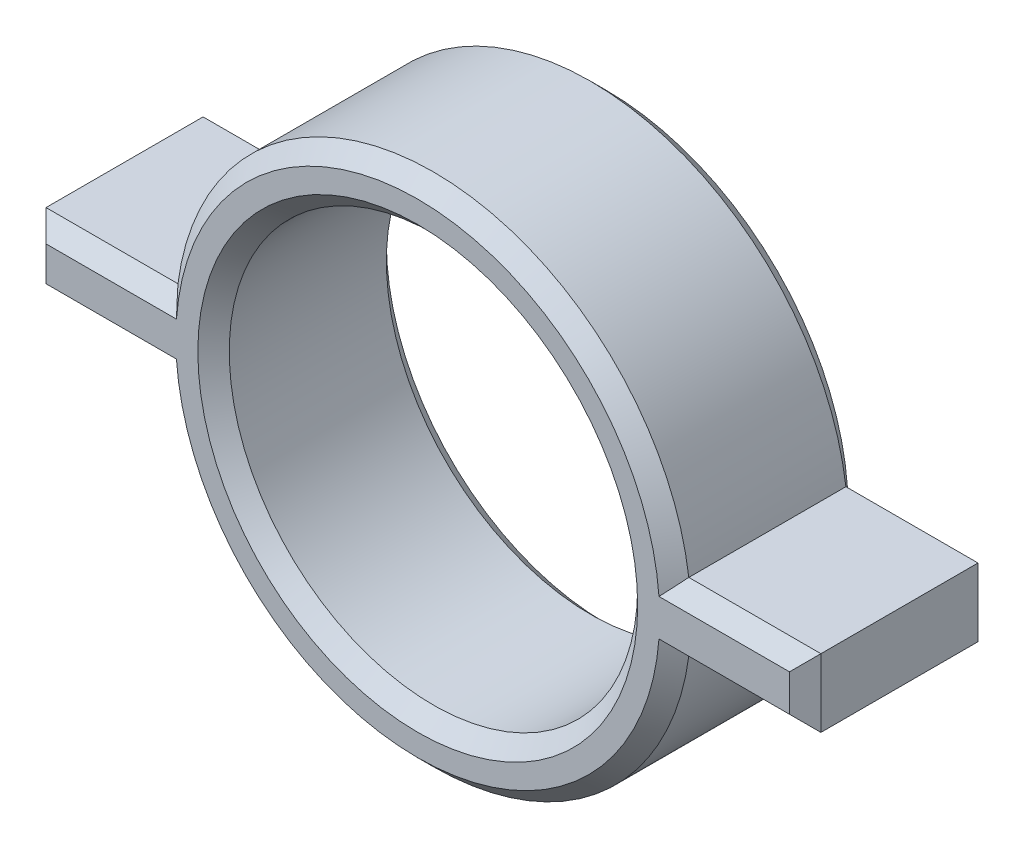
ISO-10303-21;
HEADER;
FILE_DESCRIPTION(('STEP AP214'),'2;1');
FILE_NAME('part.step','',(''),(''),'','','');
FILE_SCHEMA(('AUTOMOTIVE_DESIGN { 1 0 10303 214 1 1 1 1 }'));
ENDSEC;
DATA;
#1=APPLICATION_CONTEXT('core data for automotive mechanical design processes');
#2=APPLICATION_PROTOCOL_DEFINITION('international standard','automotive_design',2000,#1);
#3=PRODUCT_CONTEXT('',#1,'mechanical');
#4=PRODUCT('Part','Part','',(#3));
#5=PRODUCT_RELATED_PRODUCT_CATEGORY('part','',(#4));
#6=PRODUCT_DEFINITION_FORMATION('','',#4);
#7=PRODUCT_DEFINITION_CONTEXT('part definition',#1,'design');
#8=PRODUCT_DEFINITION('design','',#6,#7);
#9=PRODUCT_DEFINITION_SHAPE('','',#8);
#10=(LENGTH_UNIT() NAMED_UNIT(*) SI_UNIT(.MILLI.,.METRE.));
#11=(NAMED_UNIT(*) PLANE_ANGLE_UNIT() SI_UNIT($,.RADIAN.));
#12=(NAMED_UNIT(*) SI_UNIT($,.STERADIAN.) SOLID_ANGLE_UNIT());
#13=UNCERTAINTY_MEASURE_WITH_UNIT(LENGTH_MEASURE(1.E-05),#10,'distance_accuracy_value','');
#14=(GEOMETRIC_REPRESENTATION_CONTEXT(3) GLOBAL_UNCERTAINTY_ASSIGNED_CONTEXT((#13)) GLOBAL_UNIT_ASSIGNED_CONTEXT((#10,
#11,#12)) REPRESENTATION_CONTEXT('',''));
#15=CARTESIAN_POINT('',(0.,0.,0.));
#16=DIRECTION('',(0.,0.,1.));
#17=DIRECTION('',(1.,0.,0.));
#18=AXIS2_PLACEMENT_3D('',#15,#16,#17);
#19=CARTESIAN_POINT('',(0.,0.,6.));
#20=DIRECTION('',(0.,0.,1.));
#21=DIRECTION('',(1.,0.,0.));
#22=AXIS2_PLACEMENT_3D('',#19,#20,#21);
#23=PLANE('',#22);
#24=CARTESIAN_POINT('',(0.,0.,6.));
#25=DIRECTION('',(0.,0.,1.));
#26=DIRECTION('',(1.,0.,0.));
#27=AXIS2_PLACEMENT_3D('',#24,#25,#26);
#28=CIRCLE('',#27,7.00000000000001);
#29=CARTESIAN_POINT('',(7.00000000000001,0.,6.));
#30=VERTEX_POINT('',#29);
#31=EDGE_CURVE('E182',#30,#30,#28,.F.);
#32=ORIENTED_EDGE('',*,*,#31,.T.);
#33=EDGE_LOOP('',(#32));
#34=FACE_BOUND('',#33,.T.);
#35=DIRECTION('',(-1.,0.,0.));
#36=VECTOR('',#35,1.);
#37=CARTESIAN_POINT('',(8.12786175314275,0.585294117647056,6.));
#38=LINE('',#37,#36);
#39=CARTESIAN_POINT('',(11.8324965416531,0.58529411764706,6.));
#40=VERTEX_POINT('',#39);
#41=CARTESIAN_POINT('',(7.6777230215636,0.585294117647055,6.));
#42=VERTEX_POINT('',#41);
#43=EDGE_CURVE('E180',#40,#42,#38,.T.);
#44=ORIENTED_EDGE('',*,*,#43,.T.);
#45=CARTESIAN_POINT('',(0.,0.,6.));
#46=DIRECTION('',(0.,0.,1.));
#47=DIRECTION('',(1.,0.,0.));
#48=AXIS2_PLACEMENT_3D('',#45,#46,#47);
#49=CIRCLE('',#48,7.7);
#50=CARTESIAN_POINT('',(-7.68033202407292,0.55,6.));
#51=VERTEX_POINT('',#50);
#52=EDGE_CURVE('E162',#42,#51,#49,.T.);
#53=ORIENTED_EDGE('',*,*,#52,.T.);
#54=DIRECTION('',(-1.,0.,0.));
#55=VECTOR('',#54,1.);
#56=CARTESIAN_POINT('',(-12.3324965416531,0.549999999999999,6.));
#57=LINE('',#56,#55);
#58=CARTESIAN_POINT('',(-11.8324965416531,0.55,6.));
#59=VERTEX_POINT('',#58);
#60=EDGE_CURVE('E170',#51,#59,#57,.T.);
#61=ORIENTED_EDGE('',*,*,#60,.T.);
#62=DIRECTION('',(0.,-1.,0.));
#63=VECTOR('',#62,1.);
#64=CARTESIAN_POINT('',(-11.8324965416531,-1.05,6.));
#65=LINE('',#64,#63);
#66=CARTESIAN_POINT('',(-11.8324965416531,-0.55,6.));
#67=VERTEX_POINT('',#66);
#68=EDGE_CURVE('E176',#59,#67,#65,.T.);
#69=ORIENTED_EDGE('',*,*,#68,.T.);
#70=DIRECTION('',(1.,0.,0.));
#71=VECTOR('',#70,1.);
#72=CARTESIAN_POINT('',(-8.13249654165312,-0.55,6.));
#73=LINE('',#72,#71);
#74=CARTESIAN_POINT('',(-7.68033202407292,-0.55,6.));
#75=VERTEX_POINT('',#74);
#76=EDGE_CURVE('E445',#67,#75,#73,.T.);
#77=ORIENTED_EDGE('',*,*,#76,.T.);
#78=CARTESIAN_POINT('',(0.,0.,6.));
#79=DIRECTION('',(0.,0.,1.));
#80=DIRECTION('',(1.,0.,0.));
#81=AXIS2_PLACEMENT_3D('',#78,#79,#80);
#82=CIRCLE('',#81,7.7);
#83=CARTESIAN_POINT('',(7.6777230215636,-0.585294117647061,6.));
#84=VERTEX_POINT('',#83);
#85=EDGE_CURVE('E447',#75,#84,#82,.T.);
#86=ORIENTED_EDGE('',*,*,#85,.T.);
#87=DIRECTION('',(1.,0.,0.));
#88=VECTOR('',#87,1.);
#89=CARTESIAN_POINT('',(12.3324965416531,-0.58529411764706,6.));
#90=LINE('',#89,#88);
#91=CARTESIAN_POINT('',(11.8324965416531,-0.58529411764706,6.));
#92=VERTEX_POINT('',#91);
#93=EDGE_CURVE('E449',#84,#92,#90,.T.);
#94=ORIENTED_EDGE('',*,*,#93,.T.);
#95=DIRECTION('',(0.,1.,0.));
#96=VECTOR('',#95,1.);
#97=CARTESIAN_POINT('',(11.8324965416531,1.08529411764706,6.));
#98=LINE('',#97,#96);
#99=EDGE_CURVE('E187',#92,#40,#98,.T.);
#100=ORIENTED_EDGE('',*,*,#99,.T.);
#101=EDGE_LOOP('',(#44,#53,#61,#69,#77,#86,#94,#100));
#102=FACE_BOUND('',#101,.T.);
#103=ADVANCED_FACE('F41',(#34,#102),#23,.T.);
#104=CARTESIAN_POINT('',(0.,0.,0.));
#105=DIRECTION('',(0.,0.,1.));
#106=DIRECTION('',(1.,0.,0.));
#107=AXIS2_PLACEMENT_3D('',#104,#105,#106);
#108=PLANE('',#107);
#109=CARTESIAN_POINT('',(0.,0.,0.));
#110=DIRECTION('',(0.,0.,1.));
#111=DIRECTION('',(1.,0.,0.));
#112=AXIS2_PLACEMENT_3D('',#109,#110,#111);
#113=CIRCLE('',#112,7.);
#114=CARTESIAN_POINT('',(7.,0.,0.));
#115=VERTEX_POINT('',#114);
#116=EDGE_CURVE('E11',#115,#115,#113,.T.);
#117=ORIENTED_EDGE('',*,*,#116,.T.);
#118=EDGE_LOOP('',(#117));
#119=FACE_BOUND('',#118,.T.);
#120=DIRECTION('',(-1.,0.,0.));
#121=VECTOR('',#120,1.);
#122=CARTESIAN_POINT('',(0.,-0.549999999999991,0.));
#123=LINE('',#122,#121);
#124=CARTESIAN_POINT('',(-7.68033202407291,-0.54999999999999,0.));
#125=VERTEX_POINT('',#124);
#126=CARTESIAN_POINT('',(-11.8324965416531,-0.549999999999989,0.));
#127=VERTEX_POINT('',#126);
#128=EDGE_CURVE('E59',#125,#127,#123,.T.);
#129=ORIENTED_EDGE('',*,*,#128,.T.);
#130=DIRECTION('',(0.,1.,0.));
#131=VECTOR('',#130,1.);
#132=CARTESIAN_POINT('',(-11.8324965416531,0.,0.));
#133=LINE('',#132,#131);
#134=CARTESIAN_POINT('',(-11.8324965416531,0.549999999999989,0.));
#135=VERTEX_POINT('',#134);
#136=EDGE_CURVE('E51',#127,#135,#133,.T.);
#137=ORIENTED_EDGE('',*,*,#136,.T.);
#138=DIRECTION('',(1.,0.,0.));
#139=VECTOR('',#138,1.);
#140=CARTESIAN_POINT('',(0.,0.549999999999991,0.));
#141=LINE('',#140,#139);
#142=CARTESIAN_POINT('',(-7.68033202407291,0.54999999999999,0.));
#143=VERTEX_POINT('',#142);
#144=EDGE_CURVE('E222',#135,#143,#141,.T.);
#145=ORIENTED_EDGE('',*,*,#144,.T.);
#146=CARTESIAN_POINT('',(0.,0.,0.));
#147=DIRECTION('',(0.,0.,1.));
#148=DIRECTION('',(1.,0.,0.));
#149=AXIS2_PLACEMENT_3D('',#146,#147,#148);
#150=CIRCLE('',#149,7.69999999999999);
#151=CARTESIAN_POINT('',(7.67772302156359,0.585294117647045,0.));
#152=VERTEX_POINT('',#151);
#153=EDGE_CURVE('E224',#143,#152,#150,.F.);
#154=ORIENTED_EDGE('',*,*,#153,.T.);
#155=DIRECTION('',(1.,0.,0.));
#156=VECTOR('',#155,1.);
#157=CARTESIAN_POINT('',(0.,0.585294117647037,0.));
#158=LINE('',#157,#156);
#159=CARTESIAN_POINT('',(11.8324965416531,0.58529411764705,0.));
#160=VERTEX_POINT('',#159);
#161=EDGE_CURVE('E226',#152,#160,#158,.T.);
#162=ORIENTED_EDGE('',*,*,#161,.T.);
#163=DIRECTION('',(0.,-1.,0.));
#164=VECTOR('',#163,1.);
#165=CARTESIAN_POINT('',(11.8324965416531,0.,0.));
#166=LINE('',#165,#164);
#167=CARTESIAN_POINT('',(11.8324965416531,-0.58529411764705,0.));
#168=VERTEX_POINT('',#167);
#169=EDGE_CURVE('E228',#160,#168,#166,.T.);
#170=ORIENTED_EDGE('',*,*,#169,.T.);
#171=DIRECTION('',(-1.,0.,0.));
#172=VECTOR('',#171,1.);
#173=CARTESIAN_POINT('',(0.,-0.58529411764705,0.));
#174=LINE('',#173,#172);
#175=CARTESIAN_POINT('',(7.67772302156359,-0.58529411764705,0.));
#176=VERTEX_POINT('',#175);
#177=EDGE_CURVE('E230',#168,#176,#174,.T.);
#178=ORIENTED_EDGE('',*,*,#177,.T.);
#179=CARTESIAN_POINT('',(0.,0.,0.));
#180=DIRECTION('',(0.,0.,1.));
#181=DIRECTION('',(1.,0.,0.));
#182=AXIS2_PLACEMENT_3D('',#179,#180,#181);
#183=CIRCLE('',#182,7.69999999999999);
#184=EDGE_CURVE('E64',#176,#125,#183,.F.);
#185=ORIENTED_EDGE('',*,*,#184,.T.);
#186=EDGE_LOOP('',(#129,#137,#145,#154,#162,#170,#178,#185));
#187=FACE_BOUND('',#186,.T.);
#188=ADVANCED_FACE('F411',(#119,#187),#108,.F.);
#189=CARTESIAN_POINT('',(-8.13249654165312,1.05,6.));
#190=DIRECTION('',(0.,-1.,0.));
#191=DIRECTION('',(1.,0.,0.));
#192=AXIS2_PLACEMENT_3D('',#189,#190,#191);
#193=PLANE('',#192);
#194=DIRECTION('',(0.,0.,-1.));
#195=VECTOR('',#194,1.);
#196=CARTESIAN_POINT('',(-12.3324965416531,1.05,6.));
#197=LINE('',#196,#195);
#198=CARTESIAN_POINT('',(-12.3324965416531,1.05,5.5));
#199=VERTEX_POINT('',#198);
#200=CARTESIAN_POINT('',(-12.3324965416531,1.05,0.500000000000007));
#201=VERTEX_POINT('',#200);
#202=EDGE_CURVE('E426',#199,#201,#197,.T.);
#203=ORIENTED_EDGE('',*,*,#202,.F.);
#204=DIRECTION('',(1.,0.,0.));
#205=VECTOR('',#204,1.);
#206=CARTESIAN_POINT('',(-8.13249654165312,1.05,5.5));
#207=LINE('',#206,#205);
#208=CARTESIAN_POINT('',(-8.13249654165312,1.05,5.5));
#209=VERTEX_POINT('',#208);
#210=EDGE_CURVE('E220',#199,#209,#207,.T.);
#211=ORIENTED_EDGE('',*,*,#210,.T.);
#212=DIRECTION('',(0.,0.,-1.));
#213=VECTOR('',#212,1.);
#214=CARTESIAN_POINT('',(-8.13249654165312,1.05,6.));
#215=LINE('',#214,#213);
#216=CARTESIAN_POINT('',(-8.13249654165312,1.05,0.500000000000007));
#217=VERTEX_POINT('',#216);
#218=EDGE_CURVE('E307',#209,#217,#215,.T.);
#219=ORIENTED_EDGE('',*,*,#218,.T.);
#220=DIRECTION('',(-1.,0.,0.));
#221=VECTOR('',#220,1.);
#222=CARTESIAN_POINT('',(-8.13249654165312,1.05,0.500000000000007));
#223=LINE('',#222,#221);
#224=EDGE_CURVE('E218',#217,#201,#223,.T.);
#225=ORIENTED_EDGE('',*,*,#224,.T.);
#226=EDGE_LOOP('',(#203,#211,#219,#225));
#227=FACE_BOUND('',#226,.T.);
#228=ADVANCED_FACE('F425',(#227),#193,.F.);
#229=CARTESIAN_POINT('',(-12.3324965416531,1.05,6.));
#230=DIRECTION('',(1.,0.,0.));
#231=DIRECTION('',(0.,0.,-1.));
#232=AXIS2_PLACEMENT_3D('',#229,#230,#231);
#233=PLANE('',#232);
#234=DIRECTION('',(0.,0.,-1.));
#235=VECTOR('',#234,1.);
#236=CARTESIAN_POINT('',(-12.3324965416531,-1.05,6.));
#237=LINE('',#236,#235);
#238=CARTESIAN_POINT('',(-12.3324965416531,-1.05,5.5));
#239=VERTEX_POINT('',#238);
#240=CARTESIAN_POINT('',(-12.3324965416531,-1.05,0.500000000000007));
#241=VERTEX_POINT('',#240);
#242=EDGE_CURVE('E434',#239,#241,#237,.T.);
#243=ORIENTED_EDGE('',*,*,#242,.F.);
#244=DIRECTION('',(0.,1.,0.));
#245=VECTOR('',#244,1.);
#246=CARTESIAN_POINT('',(-12.3324965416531,1.05,5.5));
#247=LINE('',#246,#245);
#248=EDGE_CURVE('E216',#239,#199,#247,.T.);
#249=ORIENTED_EDGE('',*,*,#248,.T.);
#250=ORIENTED_EDGE('',*,*,#202,.T.);
#251=DIRECTION('',(0.,-1.,0.));
#252=VECTOR('',#251,1.);
#253=CARTESIAN_POINT('',(-12.3324965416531,1.05,0.500000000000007));
#254=LINE('',#253,#252);
#255=EDGE_CURVE('E213',#201,#241,#254,.T.);
#256=ORIENTED_EDGE('',*,*,#255,.T.);
#257=EDGE_LOOP('',(#243,#249,#250,#256));
#258=FACE_BOUND('',#257,.T.);
#259=ADVANCED_FACE('F430',(#258),#233,.F.);
#260=CARTESIAN_POINT('',(-12.3324965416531,-1.05,6.));
#261=DIRECTION('',(0.,1.,0.));
#262=DIRECTION('',(-1.,0.,0.));
#263=AXIS2_PLACEMENT_3D('',#260,#261,#262);
#264=PLANE('',#263);
#265=DIRECTION('',(0.,0.,-1.));
#266=VECTOR('',#265,1.);
#267=CARTESIAN_POINT('',(-8.13249654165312,-1.05,6.));
#268=LINE('',#267,#266);
#269=CARTESIAN_POINT('',(-8.13249654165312,-1.05,5.5));
#270=VERTEX_POINT('',#269);
#271=CARTESIAN_POINT('',(-8.13249654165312,-1.05,0.500000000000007));
#272=VERTEX_POINT('',#271);
#273=EDGE_CURVE('E438',#270,#272,#268,.T.);
#274=ORIENTED_EDGE('',*,*,#273,.F.);
#275=DIRECTION('',(-1.,0.,0.));
#276=VECTOR('',#275,1.);
#277=CARTESIAN_POINT('',(-12.3324965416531,-1.05,5.5));
#278=LINE('',#277,#276);
#279=EDGE_CURVE('E211',#270,#239,#278,.T.);
#280=ORIENTED_EDGE('',*,*,#279,.T.);
#281=ORIENTED_EDGE('',*,*,#242,.T.);
#282=DIRECTION('',(1.,0.,0.));
#283=VECTOR('',#282,1.);
#284=CARTESIAN_POINT('',(-12.3324965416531,-1.05,0.500000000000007));
#285=LINE('',#284,#283);
#286=EDGE_CURVE('E209',#241,#272,#285,.T.);
#287=ORIENTED_EDGE('',*,*,#286,.T.);
#288=EDGE_LOOP('',(#274,#280,#281,#287));
#289=FACE_BOUND('',#288,.T.);
#290=ADVANCED_FACE('F500',(#289),#264,.F.);
#291=CARTESIAN_POINT('',(0.,0.,6.));
#292=DIRECTION('',(0.,0.,-1.));
#293=DIRECTION('',(-1.,0.,0.));
#294=AXIS2_PLACEMENT_3D('',#291,#292,#293);
#295=CYLINDRICAL_SURFACE('',#294,8.2);
#296=DIRECTION('',(0.,0.,-1.));
#297=VECTOR('',#296,1.);
#298=CARTESIAN_POINT('',(8.12786175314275,-1.08529411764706,6.));
#299=LINE('',#298,#297);
#300=CARTESIAN_POINT('',(8.12786175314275,-1.08529411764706,5.5));
#301=VERTEX_POINT('',#300);
#302=CARTESIAN_POINT('',(8.12786175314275,-1.08529411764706,0.500000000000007));
#303=VERTEX_POINT('',#302);
#304=EDGE_CURVE('E487',#301,#303,#299,.T.);
#305=ORIENTED_EDGE('',*,*,#304,.F.);
#306=CARTESIAN_POINT('',(0.,0.,5.5));
#307=DIRECTION('',(0.,0.,1.));
#308=DIRECTION('',(1.,0.,0.));
#309=AXIS2_PLACEMENT_3D('',#306,#307,#308);
#310=CIRCLE('',#309,8.2);
#311=EDGE_CURVE('E207',#301,#270,#310,.F.);
#312=ORIENTED_EDGE('',*,*,#311,.T.);
#313=ORIENTED_EDGE('',*,*,#273,.T.);
#314=CARTESIAN_POINT('',(0.,0.,0.500000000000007));
#315=DIRECTION('',(0.,0.,1.));
#316=DIRECTION('',(1.,0.,0.));
#317=AXIS2_PLACEMENT_3D('',#314,#315,#316);
#318=CIRCLE('',#317,8.2);
#319=EDGE_CURVE('E205',#272,#303,#318,.T.);
#320=ORIENTED_EDGE('',*,*,#319,.T.);
#321=EDGE_LOOP('',(#305,#312,#313,#320));
#322=FACE_BOUND('',#321,.T.);
#323=ADVANCED_FACE('F494',(#322),#295,.T.);
#324=CARTESIAN_POINT('',(8.12786175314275,-1.08529411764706,6.));
#325=DIRECTION('',(0.,1.,0.));
#326=DIRECTION('',(0.,0.,1.));
#327=AXIS2_PLACEMENT_3D('',#324,#325,#326);
#328=PLANE('',#327);
#329=DIRECTION('',(0.,0.,-1.));
#330=VECTOR('',#329,1.);
#331=CARTESIAN_POINT('',(12.3324965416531,-1.08529411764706,6.));
#332=LINE('',#331,#330);
#333=CARTESIAN_POINT('',(12.3324965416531,-1.08529411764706,5.5));
#334=VERTEX_POINT('',#333);
#335=CARTESIAN_POINT('',(12.3324965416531,-1.08529411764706,0.500000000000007));
#336=VERTEX_POINT('',#335);
#337=EDGE_CURVE('E484',#334,#336,#332,.T.);
#338=ORIENTED_EDGE('',*,*,#337,.F.);
#339=DIRECTION('',(-1.,0.,0.));
#340=VECTOR('',#339,1.);
#341=CARTESIAN_POINT('',(8.12786175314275,-1.08529411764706,5.5));
#342=LINE('',#341,#340);
#343=EDGE_CURVE('E203',#334,#301,#342,.T.);
#344=ORIENTED_EDGE('',*,*,#343,.T.);
#345=ORIENTED_EDGE('',*,*,#304,.T.);
#346=DIRECTION('',(1.,0.,0.));
#347=VECTOR('',#346,1.);
#348=CARTESIAN_POINT('',(8.12786175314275,-1.08529411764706,0.500000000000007));
#349=LINE('',#348,#347);
#350=EDGE_CURVE('E201',#303,#336,#349,.T.);
#351=ORIENTED_EDGE('',*,*,#350,.T.);
#352=EDGE_LOOP('',(#338,#344,#345,#351));
#353=FACE_BOUND('',#352,.T.);
#354=ADVANCED_FACE('F507',(#353),#328,.F.);
#355=CARTESIAN_POINT('',(12.3324965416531,-1.08529411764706,6.));
#356=DIRECTION('',(-1.,0.,0.));
#357=DIRECTION('',(0.,0.,1.));
#358=AXIS2_PLACEMENT_3D('',#355,#356,#357);
#359=PLANE('',#358);
#360=DIRECTION('',(0.,0.,-1.));
#361=VECTOR('',#360,1.);
#362=CARTESIAN_POINT('',(12.3324965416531,1.08529411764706,6.));
#363=LINE('',#362,#361);
#364=CARTESIAN_POINT('',(12.3324965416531,1.08529411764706,5.5));
#365=VERTEX_POINT('',#364);
#366=CARTESIAN_POINT('',(12.3324965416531,1.08529411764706,0.500000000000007));
#367=VERTEX_POINT('',#366);
#368=EDGE_CURVE('E479',#365,#367,#363,.T.);
#369=ORIENTED_EDGE('',*,*,#368,.F.);
#370=DIRECTION('',(0.,-1.,0.));
#371=VECTOR('',#370,1.);
#372=CARTESIAN_POINT('',(12.3324965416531,-1.08529411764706,5.5));
#373=LINE('',#372,#371);
#374=EDGE_CURVE('E199',#365,#334,#373,.T.);
#375=ORIENTED_EDGE('',*,*,#374,.T.);
#376=ORIENTED_EDGE('',*,*,#337,.T.);
#377=DIRECTION('',(0.,1.,0.));
#378=VECTOR('',#377,1.);
#379=CARTESIAN_POINT('',(12.3324965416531,-1.08529411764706,0.500000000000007));
#380=LINE('',#379,#378);
#381=EDGE_CURVE('E197',#336,#367,#380,.T.);
#382=ORIENTED_EDGE('',*,*,#381,.T.);
#383=EDGE_LOOP('',(#369,#375,#376,#382));
#384=FACE_BOUND('',#383,.T.);
#385=ADVANCED_FACE('F526',(#384),#359,.F.);
#386=CARTESIAN_POINT('',(12.3324965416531,1.08529411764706,6.));
#387=DIRECTION('',(0.,-1.,0.));
#388=DIRECTION('',(1.,0.,0.));
#389=AXIS2_PLACEMENT_3D('',#386,#387,#388);
#390=PLANE('',#389);
#391=DIRECTION('',(0.,0.,-1.));
#392=VECTOR('',#391,1.);
#393=CARTESIAN_POINT('',(8.12786175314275,1.08529411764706,6.));
#394=LINE('',#393,#392);
#395=CARTESIAN_POINT('',(8.12786175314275,1.08529411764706,5.5));
#396=VERTEX_POINT('',#395);
#397=CARTESIAN_POINT('',(8.12786175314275,1.08529411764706,0.500000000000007));
#398=VERTEX_POINT('',#397);
#399=EDGE_CURVE('E477',#396,#398,#394,.T.);
#400=ORIENTED_EDGE('',*,*,#399,.F.);
#401=DIRECTION('',(1.,0.,0.));
#402=VECTOR('',#401,1.);
#403=CARTESIAN_POINT('',(12.3324965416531,1.08529411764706,5.5));
#404=LINE('',#403,#402);
#405=EDGE_CURVE('E195',#396,#365,#404,.T.);
#406=ORIENTED_EDGE('',*,*,#405,.T.);
#407=ORIENTED_EDGE('',*,*,#368,.T.);
#408=DIRECTION('',(-1.,0.,0.));
#409=VECTOR('',#408,1.);
#410=CARTESIAN_POINT('',(12.3324965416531,1.08529411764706,0.500000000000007));
#411=LINE('',#410,#409);
#412=EDGE_CURVE('E193',#367,#398,#411,.T.);
#413=ORIENTED_EDGE('',*,*,#412,.T.);
#414=EDGE_LOOP('',(#400,#406,#407,#413));
#415=FACE_BOUND('',#414,.T.);
#416=ADVANCED_FACE('F523',(#415),#390,.F.);
#417=CARTESIAN_POINT('',(0.,0.,6.));
#418=DIRECTION('',(0.,0.,-1.));
#419=DIRECTION('',(-1.,0.,0.));
#420=AXIS2_PLACEMENT_3D('',#417,#418,#419);
#421=CYLINDRICAL_SURFACE('',#420,8.2);
#422=ORIENTED_EDGE('',*,*,#218,.F.);
#423=CARTESIAN_POINT('',(0.,0.,5.5));
#424=DIRECTION('',(0.,0.,1.));
#425=DIRECTION('',(1.,0.,0.));
#426=AXIS2_PLACEMENT_3D('',#423,#424,#425);
#427=CIRCLE('',#426,8.2);
#428=EDGE_CURVE('E164',#209,#396,#427,.F.);
#429=ORIENTED_EDGE('',*,*,#428,.T.);
#430=ORIENTED_EDGE('',*,*,#399,.T.);
#431=CARTESIAN_POINT('',(0.,0.,0.500000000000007));
#432=DIRECTION('',(0.,0.,1.));
#433=DIRECTION('',(1.,0.,0.));
#434=AXIS2_PLACEMENT_3D('',#431,#432,#433);
#435=CIRCLE('',#434,8.2);
#436=EDGE_CURVE('E185',#398,#217,#435,.T.);
#437=ORIENTED_EDGE('',*,*,#436,.T.);
#438=EDGE_LOOP('',(#422,#429,#430,#437));
#439=FACE_BOUND('',#438,.T.);
#440=ADVANCED_FACE('F474',(#439),#421,.T.);
#441=CARTESIAN_POINT('',(0.,0.,6.));
#442=DIRECTION('',(0.,0.,-1.));
#443=DIRECTION('',(-1.,0.,0.));
#444=AXIS2_PLACEMENT_3D('',#441,#442,#443);
#445=CYLINDRICAL_SURFACE('',#444,6.5);
#446=CARTESIAN_POINT('',(0.,0.,5.49999999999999));
#447=DIRECTION('',(0.,0.,1.));
#448=DIRECTION('',(1.,0.,0.));
#449=AXIS2_PLACEMENT_3D('',#446,#447,#448);
#450=CIRCLE('',#449,6.5);
#451=CARTESIAN_POINT('',(6.5,0.,5.49999999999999));
#452=VERTEX_POINT('',#451);
#453=EDGE_CURVE('E177',#452,#452,#450,.T.);
#454=ORIENTED_EDGE('',*,*,#453,.T.);
#455=EDGE_LOOP('',(#454));
#456=FACE_BOUND('',#455,.T.);
#457=CARTESIAN_POINT('',(0.,0.,0.500000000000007));
#458=DIRECTION('',(0.,0.,1.));
#459=DIRECTION('',(1.,0.,0.));
#460=AXIS2_PLACEMENT_3D('',#457,#458,#459);
#461=CIRCLE('',#460,6.5);
#462=CARTESIAN_POINT('',(6.5,0.,0.500000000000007));
#463=VERTEX_POINT('',#462);
#464=EDGE_CURVE('E433',#463,#463,#461,.F.);
#465=ORIENTED_EDGE('',*,*,#464,.T.);
#466=EDGE_LOOP('',(#465));
#467=FACE_BOUND('',#466,.T.);
#468=ADVANCED_FACE('F519',(#456,#467),#445,.F.);
#469=CARTESIAN_POINT('',(0.,0.,5.49999999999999));
#470=DIRECTION('',(0.,0.,1.));
#471=DIRECTION('',(1.,0.,0.));
#472=AXIS2_PLACEMENT_3D('',#469,#470,#471);
#473=CONICAL_SURFACE('',#472,6.5,0.785398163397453);
#474=ORIENTED_EDGE('',*,*,#31,.F.);
#475=EDGE_LOOP('',(#474));
#476=FACE_BOUND('',#475,.T.);
#477=ORIENTED_EDGE('',*,*,#453,.F.);
#478=EDGE_LOOP('',(#477));
#479=FACE_BOUND('',#478,.T.);
#480=ADVANCED_FACE('F287',(#476,#479),#473,.F.);
#481=CARTESIAN_POINT('',(0.,0.,6.));
#482=DIRECTION('',(0.,0.,-1.));
#483=DIRECTION('',(-1.,0.,0.));
#484=AXIS2_PLACEMENT_3D('',#481,#482,#483);
#485=CONICAL_SURFACE('',#484,7.7,0.785398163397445);
#486=CARTESIAN_POINT('',(-8.13249654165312,-1.05,5.5));
#487=CARTESIAN_POINT('',(-8.05866523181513,-0.965975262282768,5.58402473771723));
#488=CARTESIAN_POINT('',(-7.98406925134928,-0.882296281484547,5.66770371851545));
#489=CARTESIAN_POINT('',(-7.83334774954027,-0.715629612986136,5.83437038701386));
#490=CARTESIAN_POINT('',(-7.75722222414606,-0.63264192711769,5.91735807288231));
#491=CARTESIAN_POINT('',(-7.68033202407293,-0.549999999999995,6.00000000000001));
#492=B_SPLINE_CURVE_WITH_KNOTS('',3,(#486,#487,#488,#489,#490,#491),.UNSPECIFIED.,.F.,.F.,(4,2,
4),(0.,0.419666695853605,0.839334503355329),.UNSPECIFIED.);
#493=EDGE_CURVE('E293',#270,#75,#492,.T.);
#494=ORIENTED_EDGE('',*,*,#493,.F.);
#495=ORIENTED_EDGE('',*,*,#311,.F.);
#496=CARTESIAN_POINT('',(8.12786175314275,-1.08529411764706,5.5));
#497=CARTESIAN_POINT('',(8.05435903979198,-1.00127654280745,5.58401757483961));
#498=CARTESIAN_POINT('',(7.9800961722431,-0.917601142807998,5.66769297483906));
#499=CARTESIAN_POINT('',(7.83004993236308,-0.750934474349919,5.83435964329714));
#500=CARTESIAN_POINT('',(7.75426655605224,-0.667943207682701,5.91735090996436));
#501=CARTESIAN_POINT('',(7.67772302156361,-0.585294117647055,6.00000000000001));
#502=B_SPLINE_CURVE_WITH_KNOTS('',3,(#496,#497,#498,#499,#500,#501),.UNSPECIFIED.,.F.,.F.,(4,2,
4),(0.,0.419121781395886,0.838244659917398),.UNSPECIFIED.);
#503=EDGE_CURVE('E300',#84,#301,#502,.F.);
#504=ORIENTED_EDGE('',*,*,#503,.F.);
#505=ORIENTED_EDGE('',*,*,#85,.F.);
#506=EDGE_LOOP('',(#494,#495,#504,#505));
#507=FACE_BOUND('',#506,.T.);
#508=ADVANCED_FACE('F279',(#507),#485,.T.);
#509=CARTESIAN_POINT('',(0.,-0.58529411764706,6.));
#510=DIRECTION('',(0.,-0.70710678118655,0.707106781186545));
#511=DIRECTION('',(-1.,0.,0.));
#512=AXIS2_PLACEMENT_3D('',#509,#510,#511);
#513=PLANE('',#512);
#514=ORIENTED_EDGE('',*,*,#503,.T.);
#515=ORIENTED_EDGE('',*,*,#343,.F.);
#516=DIRECTION('',(-0.577350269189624,0.577350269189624,0.577350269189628));
#517=VECTOR('',#516,1.);
#518=CARTESIAN_POINT('',(7.88833102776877,3.3588713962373,9.94416551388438));
#519=LINE('',#518,#517);
#520=EDGE_CURVE('E463',#92,#334,#519,.F.);
#521=ORIENTED_EDGE('',*,*,#520,.F.);
#522=ORIENTED_EDGE('',*,*,#93,.F.);
#523=EDGE_LOOP('',(#514,#515,#521,#522));
#524=FACE_BOUND('',#523,.T.);
#525=ADVANCED_FACE('F286',(#524),#513,.T.);
#526=CARTESIAN_POINT('',(0.,-0.550000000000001,6.));
#527=DIRECTION('',(0.,-0.70710678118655,0.707106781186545));
#528=DIRECTION('',(-1.,0.,0.));
#529=AXIS2_PLACEMENT_3D('',#526,#527,#528);
#530=PLANE('',#529);
#531=ORIENTED_EDGE('',*,*,#493,.T.);
#532=ORIENTED_EDGE('',*,*,#76,.F.);
#533=DIRECTION('',(0.577350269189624,0.577350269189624,0.577350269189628));
#534=VECTOR('',#533,1.);
#535=CARTESIAN_POINT('',(-11.6491632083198,-0.366666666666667,6.18333333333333));
#536=LINE('',#535,#534);
#537=EDGE_CURVE('E459',#239,#67,#536,.T.);
#538=ORIENTED_EDGE('',*,*,#537,.F.);
#539=ORIENTED_EDGE('',*,*,#279,.F.);
#540=EDGE_LOOP('',(#531,#532,#538,#539));
#541=FACE_BOUND('',#540,.T.);
#542=ADVANCED_FACE('F277',(#541),#530,.T.);
#543=CARTESIAN_POINT('',(11.8324965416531,0.,6.));
#544=DIRECTION('',(0.70710678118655,0.,0.707106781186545));
#545=DIRECTION('',(0.,-1.,0.));
#546=AXIS2_PLACEMENT_3D('',#543,#544,#545);
#547=PLANE('',#546);
#548=ORIENTED_EDGE('',*,*,#520,.T.);
#549=ORIENTED_EDGE('',*,*,#374,.F.);
#550=DIRECTION('',(-0.577350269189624,-0.577350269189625,0.577350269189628));
#551=VECTOR('',#550,1.);
#552=CARTESIAN_POINT('',(11.6373985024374,0.390196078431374,6.19509803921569));
#553=LINE('',#552,#551);
#554=EDGE_CURVE('E457',#40,#365,#553,.F.);
#555=ORIENTED_EDGE('',*,*,#554,.F.);
#556=ORIENTED_EDGE('',*,*,#99,.F.);
#557=EDGE_LOOP('',(#548,#549,#555,#556));
#558=FACE_BOUND('',#557,.T.);
#559=ADVANCED_FACE('F270',(#558),#547,.T.);
#560=CARTESIAN_POINT('',(-11.8324965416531,0.,6.));
#561=DIRECTION('',(-0.70710678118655,0.,0.707106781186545));
#562=DIRECTION('',(0.,1.,0.));
#563=AXIS2_PLACEMENT_3D('',#560,#561,#562);
#564=PLANE('',#563);
#565=ORIENTED_EDGE('',*,*,#537,.T.);
#566=ORIENTED_EDGE('',*,*,#68,.F.);
#567=DIRECTION('',(0.577350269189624,-0.577350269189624,0.577350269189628));
#568=VECTOR('',#567,1.);
#569=CARTESIAN_POINT('',(-7.88833102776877,-3.39416551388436,9.94416551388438));
#570=LINE('',#569,#568);
#571=EDGE_CURVE('E173',#199,#59,#570,.T.);
#572=ORIENTED_EDGE('',*,*,#571,.F.);
#573=ORIENTED_EDGE('',*,*,#248,.F.);
#574=EDGE_LOOP('',(#565,#566,#572,#573));
#575=FACE_BOUND('',#574,.T.);
#576=ADVANCED_FACE('F263',(#575),#564,.T.);
#577=CARTESIAN_POINT('',(0.,0.585294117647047,6.));
#578=DIRECTION('',(0.,0.70710678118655,0.707106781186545));
#579=DIRECTION('',(1.,0.,0.));
#580=AXIS2_PLACEMENT_3D('',#577,#578,#579);
#581=PLANE('',#580);
#582=ORIENTED_EDGE('',*,*,#554,.T.);
#583=ORIENTED_EDGE('',*,*,#405,.F.);
#584=CARTESIAN_POINT('',(8.12786175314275,1.08529411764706,5.5));
#585=CARTESIAN_POINT('',(8.05435903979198,1.00127654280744,5.58401757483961));
#586=CARTESIAN_POINT('',(7.9800961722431,0.917601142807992,5.66769297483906));
#587=CARTESIAN_POINT('',(7.83004993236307,0.750934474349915,5.83435964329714));
#588=CARTESIAN_POINT('',(7.75426655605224,0.667943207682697,5.91735090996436));
#589=CARTESIAN_POINT('',(7.67772302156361,0.585294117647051,6.00000000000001));
#590=B_SPLINE_CURVE_WITH_KNOTS('',3,(#584,#585,#586,#587,#588,#589),.UNSPECIFIED.,.F.,.F.,(4,2,
4),(0.,0.419121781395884,0.838244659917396),.UNSPECIFIED.);
#591=EDGE_CURVE('E167',#42,#396,#590,.F.);
#592=ORIENTED_EDGE('',*,*,#591,.F.);
#593=ORIENTED_EDGE('',*,*,#43,.F.);
#594=EDGE_LOOP('',(#582,#583,#592,#593));
#595=FACE_BOUND('',#594,.T.);
#596=ADVANCED_FACE('F256',(#595),#581,.T.);
#597=CARTESIAN_POINT('',(0.,0.550000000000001,6.));
#598=DIRECTION('',(0.,0.70710678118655,0.707106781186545));
#599=DIRECTION('',(1.,0.,0.));
#600=AXIS2_PLACEMENT_3D('',#597,#598,#599);
#601=PLANE('',#600);
#602=ORIENTED_EDGE('',*,*,#571,.T.);
#603=ORIENTED_EDGE('',*,*,#60,.F.);
#604=CARTESIAN_POINT('',(-7.68033202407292,0.55,6.));
#605=CARTESIAN_POINT('',(-7.75722222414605,0.632641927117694,5.91735807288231));
#606=CARTESIAN_POINT('',(-7.83334774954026,0.715629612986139,5.83437038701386));
#607=CARTESIAN_POINT('',(-7.98406925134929,0.882296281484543,5.66770371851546));
#608=CARTESIAN_POINT('',(-8.05866523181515,0.965975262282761,5.58402473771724));
#609=CARTESIAN_POINT('',(-8.13249654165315,1.04999999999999,5.50000000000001));
#610=B_SPLINE_CURVE_WITH_KNOTS('',3,(#604,#605,#606,#607,#608,#609),.UNSPECIFIED.,.F.,.F.,(4,2,
4),(0.,0.419667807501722,0.839334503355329),.UNSPECIFIED.);
#611=EDGE_CURVE('E158',#209,#51,#610,.F.);
#612=ORIENTED_EDGE('',*,*,#611,.F.);
#613=ORIENTED_EDGE('',*,*,#210,.F.);
#614=EDGE_LOOP('',(#602,#603,#612,#613));
#615=FACE_BOUND('',#614,.T.);
#616=ADVANCED_FACE('F171',(#615),#601,.T.);
#617=CARTESIAN_POINT('',(0.,0.,6.));
#618=DIRECTION('',(0.,0.,-1.));
#619=DIRECTION('',(-1.,0.,0.));
#620=AXIS2_PLACEMENT_3D('',#617,#618,#619);
#621=CONICAL_SURFACE('',#620,7.7,0.785398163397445);
#622=ORIENTED_EDGE('',*,*,#591,.T.);
#623=ORIENTED_EDGE('',*,*,#428,.F.);
#624=ORIENTED_EDGE('',*,*,#611,.T.);
#625=ORIENTED_EDGE('',*,*,#52,.F.);
#626=EDGE_LOOP('',(#622,#623,#624,#625));
#627=FACE_BOUND('',#626,.T.);
#628=ADVANCED_FACE('F160',(#627),#621,.T.);
#629=CARTESIAN_POINT('',(0.,0.,0.));
#630=DIRECTION('',(0.,0.,-1.));
#631=DIRECTION('',(-1.,0.,0.));
#632=AXIS2_PLACEMENT_3D('',#629,#630,#631);
#633=CONICAL_SURFACE('',#632,7.,0.785398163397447);
#634=ORIENTED_EDGE('',*,*,#464,.F.);
#635=EDGE_LOOP('',(#634));
#636=FACE_BOUND('',#635,.T.);
#637=ORIENTED_EDGE('',*,*,#116,.F.);
#638=EDGE_LOOP('',(#637));
#639=FACE_BOUND('',#638,.T.);
#640=ADVANCED_FACE('F319',(#636,#639),#633,.F.);
#641=CARTESIAN_POINT('',(12.3324965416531,-1.08529411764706,0.500000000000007));
#642=DIRECTION('',(-0.707106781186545,0.,0.70710678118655));
#643=DIRECTION('',(0.,1.,0.));
#644=AXIS2_PLACEMENT_3D('',#641,#642,#643);
#645=PLANE('',#644);
#646=DIRECTION('',(-0.577350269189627,0.577350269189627,-0.577350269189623));
#647=VECTOR('',#646,1.);
#648=CARTESIAN_POINT('',(12.3324965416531,-1.08529411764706,0.500000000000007));
#649=LINE('',#648,#647);
#650=EDGE_CURVE('E398',#168,#336,#649,.F.);
#651=ORIENTED_EDGE('',*,*,#650,.F.);
#652=ORIENTED_EDGE('',*,*,#169,.F.);
#653=DIRECTION('',(-0.577350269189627,-0.577350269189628,-0.577350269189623));
#654=VECTOR('',#653,1.);
#655=CARTESIAN_POINT('',(12.3324965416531,1.08529411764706,0.500000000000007));
#656=LINE('',#655,#654);
#657=EDGE_CURVE('E46',#367,#160,#656,.T.);
#658=ORIENTED_EDGE('',*,*,#657,.F.);
#659=ORIENTED_EDGE('',*,*,#381,.F.);
#660=EDGE_LOOP('',(#651,#652,#658,#659));
#661=FACE_BOUND('',#660,.T.);
#662=ADVANCED_FACE('F44',(#661),#645,.F.);
#663=CARTESIAN_POINT('',(12.3324965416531,1.08529411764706,0.500000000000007));
#664=DIRECTION('',(0.,-0.707106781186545,0.70710678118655));
#665=DIRECTION('',(-1.,0.,0.));
#666=AXIS2_PLACEMENT_3D('',#663,#664,#665);
#667=PLANE('',#666);
#668=ORIENTED_EDGE('',*,*,#657,.T.);
#669=ORIENTED_EDGE('',*,*,#161,.F.);
#670=CARTESIAN_POINT('',(8.12786175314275,1.08529411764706,0.500000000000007));
#671=CARTESIAN_POINT('',(8.05435903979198,1.00127654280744,0.415982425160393));
#672=CARTESIAN_POINT('',(7.9800961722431,0.917601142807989,0.332307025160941));
#673=CARTESIAN_POINT('',(7.83004993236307,0.750934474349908,0.165640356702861));
#674=CARTESIAN_POINT('',(7.75426655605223,0.667943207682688,0.082649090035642));
#675=CARTESIAN_POINT('',(7.67772302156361,0.58529411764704,0.));
#676=B_SPLINE_CURVE_WITH_KNOTS('',3,(#670,#671,#672,#673,#674,#675),.UNSPECIFIED.,.F.,.F.,(4,2,
4),(0.,0.419121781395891,0.838244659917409),.UNSPECIFIED.);
#677=EDGE_CURVE('E392',#398,#152,#676,.T.);
#678=ORIENTED_EDGE('',*,*,#677,.F.);
#679=ORIENTED_EDGE('',*,*,#412,.F.);
#680=EDGE_LOOP('',(#668,#669,#678,#679));
#681=FACE_BOUND('',#680,.T.);
#682=ADVANCED_FACE('F385',(#681),#667,.F.);
#683=CARTESIAN_POINT('',(8.12786175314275,-1.08529411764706,0.500000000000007));
#684=DIRECTION('',(0.,0.707106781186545,0.70710678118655));
#685=DIRECTION('',(1.,0.,0.));
#686=AXIS2_PLACEMENT_3D('',#683,#684,#685);
#687=PLANE('',#686);
#688=ORIENTED_EDGE('',*,*,#650,.T.);
#689=ORIENTED_EDGE('',*,*,#350,.F.);
#690=CARTESIAN_POINT('',(8.12786175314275,-1.08529411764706,0.500000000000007));
#691=CARTESIAN_POINT('',(8.05435903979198,-1.00127654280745,0.415982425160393));
#692=CARTESIAN_POINT('',(7.9800961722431,-0.917601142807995,0.332307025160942));
#693=CARTESIAN_POINT('',(7.83004993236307,-0.750934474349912,0.165640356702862));
#694=CARTESIAN_POINT('',(7.75426655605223,-0.667943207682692,0.0826490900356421));
#695=CARTESIAN_POINT('',(7.6777230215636,-0.585294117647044,0.));
#696=B_SPLINE_CURVE_WITH_KNOTS('',3,(#690,#691,#692,#693,#694,#695),.UNSPECIFIED.,.F.,.F.,(4,2,
4),(0.,0.419121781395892,0.838244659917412),.UNSPECIFIED.);
#697=EDGE_CURVE('E362',#176,#303,#696,.F.);
#698=ORIENTED_EDGE('',*,*,#697,.F.);
#699=ORIENTED_EDGE('',*,*,#177,.F.);
#700=EDGE_LOOP('',(#688,#689,#698,#699));
#701=FACE_BOUND('',#700,.T.);
#702=ADVANCED_FACE('F379',(#701),#687,.F.);
#703=CARTESIAN_POINT('',(0.,0.,0.500000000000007));
#704=DIRECTION('',(0.,0.,1.));
#705=DIRECTION('',(1.,0.,0.));
#706=AXIS2_PLACEMENT_3D('',#703,#704,#705);
#707=CONICAL_SURFACE('',#706,8.2,0.785398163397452);
#708=ORIENTED_EDGE('',*,*,#677,.T.);
#709=ORIENTED_EDGE('',*,*,#153,.F.);
#710=CARTESIAN_POINT('',(-8.13249654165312,1.05,0.500000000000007));
#711=CARTESIAN_POINT('',(-8.05866523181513,0.965975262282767,0.415975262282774));
#712=CARTESIAN_POINT('',(-7.98406925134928,0.882296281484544,0.332296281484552));
#713=CARTESIAN_POINT('',(-7.83334774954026,0.71562961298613,0.165629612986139));
#714=CARTESIAN_POINT('',(-7.75722222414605,0.632641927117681,0.0826419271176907));
#715=CARTESIAN_POINT('',(-7.68033202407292,0.549999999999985,0.));
#716=B_SPLINE_CURVE_WITH_KNOTS('',3,(#710,#711,#712,#713,#714,#715),.UNSPECIFIED.,.F.,.F.,(4,2,
4),(0.,0.419666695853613,0.839334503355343),.UNSPECIFIED.);
#717=EDGE_CURVE('E353',#217,#143,#716,.T.);
#718=ORIENTED_EDGE('',*,*,#717,.F.);
#719=ORIENTED_EDGE('',*,*,#436,.F.);
#720=EDGE_LOOP('',(#708,#709,#718,#719));
#721=FACE_BOUND('',#720,.T.);
#722=ADVANCED_FACE('F370',(#721),#707,.T.);
#723=CARTESIAN_POINT('',(0.,0.,0.500000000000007));
#724=DIRECTION('',(0.,0.,1.));
#725=DIRECTION('',(1.,0.,0.));
#726=AXIS2_PLACEMENT_3D('',#723,#724,#725);
#727=CONICAL_SURFACE('',#726,8.2,0.785398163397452);
#728=ORIENTED_EDGE('',*,*,#697,.T.);
#729=ORIENTED_EDGE('',*,*,#319,.F.);
#730=CARTESIAN_POINT('',(-8.13249654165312,-1.05,0.500000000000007));
#731=CARTESIAN_POINT('',(-8.05866523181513,-0.965975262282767,0.415975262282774));
#732=CARTESIAN_POINT('',(-7.98406925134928,-0.882296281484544,0.332296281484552));
#733=CARTESIAN_POINT('',(-7.83334774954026,-0.71562961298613,0.165629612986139));
#734=CARTESIAN_POINT('',(-7.75722222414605,-0.632641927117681,0.0826419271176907));
#735=CARTESIAN_POINT('',(-7.68033202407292,-0.549999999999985,0.));
#736=B_SPLINE_CURVE_WITH_KNOTS('',3,(#730,#731,#732,#733,#734,#735),.UNSPECIFIED.,.F.,.F.,(4,2,
4),(0.,0.419666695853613,0.839334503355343),.UNSPECIFIED.);
#737=EDGE_CURVE('E346',#125,#272,#736,.F.);
#738=ORIENTED_EDGE('',*,*,#737,.F.);
#739=ORIENTED_EDGE('',*,*,#184,.F.);
#740=EDGE_LOOP('',(#728,#729,#738,#739));
#741=FACE_BOUND('',#740,.T.);
#742=ADVANCED_FACE('F342',(#741),#727,.T.);
#743=CARTESIAN_POINT('',(-8.13249654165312,1.05,0.500000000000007));
#744=DIRECTION('',(0.,-0.707106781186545,0.70710678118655));
#745=DIRECTION('',(-1.,0.,0.));
#746=AXIS2_PLACEMENT_3D('',#743,#744,#745);
#747=PLANE('',#746);
#748=ORIENTED_EDGE('',*,*,#717,.T.);
#749=ORIENTED_EDGE('',*,*,#144,.F.);
#750=DIRECTION('',(-0.577350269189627,0.577350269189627,0.577350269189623));
#751=VECTOR('',#750,1.);
#752=CARTESIAN_POINT('',(-10.9324965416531,-0.350000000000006,-0.899999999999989));
#753=LINE('',#752,#751);
#754=EDGE_CURVE('E354',#201,#135,#753,.F.);
#755=ORIENTED_EDGE('',*,*,#754,.F.);
#756=ORIENTED_EDGE('',*,*,#224,.F.);
#757=EDGE_LOOP('',(#748,#749,#755,#756));
#758=FACE_BOUND('',#757,.T.);
#759=ADVANCED_FACE('F340',(#758),#747,.F.);
#760=CARTESIAN_POINT('',(-12.3324965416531,-1.05,0.500000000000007));
#761=DIRECTION('',(0.,0.707106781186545,0.70710678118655));
#762=DIRECTION('',(1.,0.,0.));
#763=AXIS2_PLACEMENT_3D('',#760,#761,#762);
#764=PLANE('',#763);
#765=ORIENTED_EDGE('',*,*,#737,.T.);
#766=ORIENTED_EDGE('',*,*,#286,.F.);
#767=DIRECTION('',(0.577350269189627,0.577350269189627,-0.577350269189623));
#768=VECTOR('',#767,1.);
#769=CARTESIAN_POINT('',(-12.3324965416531,-1.05,0.500000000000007));
#770=LINE('',#769,#768);
#771=EDGE_CURVE('E308',#127,#241,#770,.F.);
#772=ORIENTED_EDGE('',*,*,#771,.F.);
#773=ORIENTED_EDGE('',*,*,#128,.F.);
#774=EDGE_LOOP('',(#765,#766,#772,#773));
#775=FACE_BOUND('',#774,.T.);
#776=ADVANCED_FACE('F332',(#775),#764,.F.);
#777=CARTESIAN_POINT('',(-12.3324965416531,1.05,0.500000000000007));
#778=DIRECTION('',(0.707106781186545,0.,0.70710678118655));
#779=DIRECTION('',(0.,-1.,0.));
#780=AXIS2_PLACEMENT_3D('',#777,#778,#779);
#781=PLANE('',#780);
#782=ORIENTED_EDGE('',*,*,#754,.T.);
#783=ORIENTED_EDGE('',*,*,#136,.F.);
#784=ORIENTED_EDGE('',*,*,#771,.T.);
#785=ORIENTED_EDGE('',*,*,#255,.F.);
#786=EDGE_LOOP('',(#782,#783,#784,#785));
#787=FACE_BOUND('',#786,.T.);
#788=ADVANCED_FACE('F326',(#787),#781,.F.);
#789=CLOSED_SHELL('',(#103,#188,#228,#259,#290,#323,#354,#385,#416,#440,#468,#480,#508,#525,
#542,#559,#576,#596,#616,#628,#640,#662,#682,#702,#722,#742,#759,#776,#788));
#790=MANIFOLD_SOLID_BREP('B2',#789);
#791=ADVANCED_BREP_SHAPE_REPRESENTATION('',(#18,#790),#14);
#792=SHAPE_DEFINITION_REPRESENTATION(#9,#791);
ENDSEC;
END-ISO-10303-21;
